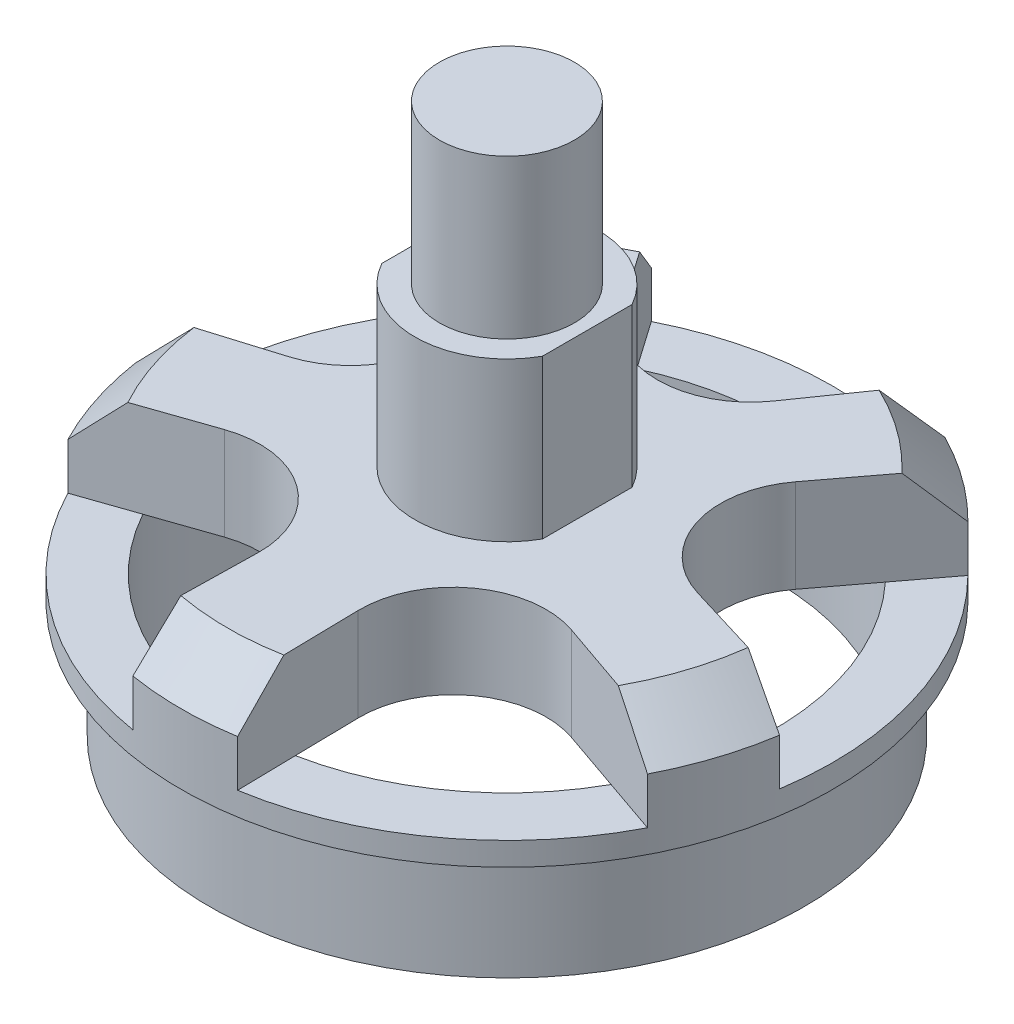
ISO-10303-21;
HEADER;
FILE_DESCRIPTION(('STEP AP214'),'2;1');
FILE_NAME('part.step','',(''),(''),'','','');
FILE_SCHEMA(('AUTOMOTIVE_DESIGN { 1 0 10303 214 1 1 1 1 }'));
ENDSEC;
DATA;
#1=APPLICATION_CONTEXT('core data for automotive mechanical design processes');
#2=APPLICATION_PROTOCOL_DEFINITION('international standard','automotive_design',2000,#1);
#3=PRODUCT_CONTEXT('',#1,'mechanical');
#4=PRODUCT('Part','Part','',(#3));
#5=PRODUCT_RELATED_PRODUCT_CATEGORY('part','',(#4));
#6=PRODUCT_DEFINITION_FORMATION('','',#4);
#7=PRODUCT_DEFINITION_CONTEXT('part definition',#1,'design');
#8=PRODUCT_DEFINITION('design','',#6,#7);
#9=PRODUCT_DEFINITION_SHAPE('','',#8);
#10=(LENGTH_UNIT() NAMED_UNIT(*) SI_UNIT(.MILLI.,.METRE.));
#11=(NAMED_UNIT(*) PLANE_ANGLE_UNIT() SI_UNIT($,.RADIAN.));
#12=(NAMED_UNIT(*) SI_UNIT($,.STERADIAN.) SOLID_ANGLE_UNIT());
#13=UNCERTAINTY_MEASURE_WITH_UNIT(LENGTH_MEASURE(1.E-05),#10,'distance_accuracy_value','');
#14=(GEOMETRIC_REPRESENTATION_CONTEXT(3) GLOBAL_UNCERTAINTY_ASSIGNED_CONTEXT((#13)) GLOBAL_UNIT_ASSIGNED_CONTEXT((#10,
#11,#12)) REPRESENTATION_CONTEXT('',''));
#15=CARTESIAN_POINT('',(0.,0.,0.));
#16=DIRECTION('',(0.,0.,1.));
#17=DIRECTION('',(1.,0.,0.));
#18=AXIS2_PLACEMENT_3D('',#15,#16,#17);
#19=CARTESIAN_POINT('',(0.,10.,0.));
#20=DIRECTION('',(0.,1.,0.));
#21=DIRECTION('',(0.,0.,1.));
#22=AXIS2_PLACEMENT_3D('',#19,#20,#21);
#23=PLANE('',#22);
#24=DIRECTION('',(0.,0.,1.));
#25=VECTOR('',#24,1.);
#26=CARTESIAN_POINT('',(-3.45,10.,-1.92353840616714));
#27=LINE('',#26,#25);
#28=CARTESIAN_POINT('',(-3.45,10.,-1.92353840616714));
#29=VERTEX_POINT('',#28);
#30=CARTESIAN_POINT('',(-3.45,10.,1.92353840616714));
#31=VERTEX_POINT('',#30);
#32=EDGE_CURVE('E499',#29,#31,#27,.T.);
#33=ORIENTED_EDGE('',*,*,#32,.F.);
#34=CARTESIAN_POINT('',(0.,10.,0.));
#35=DIRECTION('',(0.,1.,0.));
#36=DIRECTION('',(0.,0.,1.));
#37=AXIS2_PLACEMENT_3D('',#34,#35,#36);
#38=CIRCLE('',#37,3.95);
#39=CARTESIAN_POINT('',(3.45,10.,-1.92353840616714));
#40=VERTEX_POINT('',#39);
#41=EDGE_CURVE('E483',#40,#29,#38,.T.);
#42=ORIENTED_EDGE('',*,*,#41,.F.);
#43=DIRECTION('',(0.,0.,-1.));
#44=VECTOR('',#43,1.);
#45=CARTESIAN_POINT('',(3.45,10.,-1.92353840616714));
#46=LINE('',#45,#44);
#47=CARTESIAN_POINT('',(3.45,10.,1.92353840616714));
#48=VERTEX_POINT('',#47);
#49=EDGE_CURVE('E490',#48,#40,#46,.T.);
#50=ORIENTED_EDGE('',*,*,#49,.F.);
#51=CARTESIAN_POINT('',(0.,10.,0.));
#52=DIRECTION('',(0.,1.,0.));
#53=DIRECTION('',(0.,0.,1.));
#54=AXIS2_PLACEMENT_3D('',#51,#52,#53);
#55=CIRCLE('',#54,3.95);
#56=EDGE_CURVE('E501',#31,#48,#55,.T.);
#57=ORIENTED_EDGE('',*,*,#56,.F.);
#58=EDGE_LOOP('',(#33,#42,#50,#57));
#59=FACE_BOUND('',#58,.T.);
#60=CARTESIAN_POINT('',(-9.94974789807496,10.,-3.23286906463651));
#61=DIRECTION('',(0.,1.,0.));
#62=DIRECTION('',(0.,0.,1.));
#63=AXIS2_PLACEMENT_3D('',#60,#61,#62);
#64=CIRCLE('',#63,4.);
#65=CARTESIAN_POINT('',(-8.78595913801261,10.,0.594087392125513));
#66=VERTEX_POINT('',#65);
#67=CARTESIAN_POINT('',(-6.7587944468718,10.,-5.64488400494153));
#68=VERTEX_POINT('',#67);
#69=EDGE_CURVE('E343',#66,#68,#64,.T.);
#70=ORIENTED_EDGE('',*,*,#69,.F.);
#71=DIRECTION('',(-0.956739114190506,0.,0.290947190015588));
#72=VECTOR('',#71,1.);
#73=CARTESIAN_POINT('',(-0.578363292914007,10.,-1.90186674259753));
#74=LINE('',#73,#72);
#75=CARTESIAN_POINT('',(-11.9006097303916,10.,1.5412618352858));
#76=VERTEX_POINT('',#75);
#77=EDGE_CURVE('E314',#66,#76,#74,.T.);
#78=ORIENTED_EDGE('',*,*,#77,.T.);
#79=CARTESIAN_POINT('',(0.,10.,0.));
#80=DIRECTION('',(0.,1.,0.));
#81=DIRECTION('',(0.,0.,1.));
#82=AXIS2_PLACEMENT_3D('',#79,#80,#81);
#83=CIRCLE('',#82,12.);
#84=CARTESIAN_POINT('',(-10.5337264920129,10.,5.74809587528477));
#85=VERTEX_POINT('',#84);
#86=EDGE_CURVE('E644',#76,#85,#83,.T.);
#87=ORIENTED_EDGE('',*,*,#86,.T.);
#88=DIRECTION('',(-0.945032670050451,0.,0.326975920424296));
#89=VECTOR('',#88,1.);
#90=CARTESIAN_POINT('',(0.649983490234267,10.,1.87859592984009));
#91=LINE('',#90,#89);
#92=CARTESIAN_POINT('',(-7.45718606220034,10.,4.68363041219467));
#93=VERTEX_POINT('',#92);
#94=EDGE_CURVE('E110',#93,#85,#91,.T.);
#95=ORIENTED_EDGE('',*,*,#94,.F.);
#96=CARTESIAN_POINT('',(-6.14928238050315,10.,8.46376109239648));
#97=DIRECTION('',(0.,1.,0.));
#98=DIRECTION('',(0.,0.,1.));
#99=AXIS2_PLACEMENT_3D('',#96,#97,#98);
#100=CIRCLE('',#99,4.);
#101=CARTESIAN_POINT('',(-2.15,10.,8.53952679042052));
#102=VERTEX_POINT('',#101);
#103=EDGE_CURVE('E401',#102,#93,#100,.T.);
#104=ORIENTED_EDGE('',*,*,#103,.F.);
#105=DIRECTION('',(-0.0189414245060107,0.,0.999820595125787));
#106=VECTOR('',#105,1.);
#107=CARTESIAN_POINT('',(-1.9875068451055,10.,-0.037652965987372));
#108=LINE('',#107,#106);
#109=CARTESIAN_POINT('',(-2.21166353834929,10.,11.7944285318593));
#110=VERTEX_POINT('',#109);
#111=EDGE_CURVE('E398',#102,#110,#108,.T.);
#112=ORIENTED_EDGE('',*,*,#111,.T.);
#113=CARTESIAN_POINT('',(2.21166353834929,10.,11.7944285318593));
#114=VERTEX_POINT('',#113);
#115=EDGE_CURVE('E647',#110,#114,#83,.T.);
#116=ORIENTED_EDGE('',*,*,#115,.T.);
#117=DIRECTION('',(0.0189414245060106,0.,0.999820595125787));
#118=VECTOR('',#117,1.);
#119=CARTESIAN_POINT('',(1.9875068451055,10.,-0.0376529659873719));
#120=LINE('',#119,#118);
#121=CARTESIAN_POINT('',(2.15,10.,8.53952679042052));
#122=VERTEX_POINT('',#121);
#123=EDGE_CURVE('E102',#122,#114,#120,.T.);
#124=ORIENTED_EDGE('',*,*,#123,.F.);
#125=CARTESIAN_POINT('',(6.14928238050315,10.,8.46376109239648));
#126=DIRECTION('',(0.,1.,0.));
#127=DIRECTION('',(0.,0.,1.));
#128=AXIS2_PLACEMENT_3D('',#125,#126,#127);
#129=CIRCLE('',#128,4.);
#130=CARTESIAN_POINT('',(7.45718606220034,10.,4.68363041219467));
#131=VERTEX_POINT('',#130);
#132=EDGE_CURVE('E430',#131,#122,#129,.T.);
#133=ORIENTED_EDGE('',*,*,#132,.F.);
#134=DIRECTION('',(0.945032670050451,0.,0.326975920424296));
#135=VECTOR('',#134,1.);
#136=CARTESIAN_POINT('',(-0.649983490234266,10.,1.87859592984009));
#137=LINE('',#136,#135);
#138=CARTESIAN_POINT('',(10.5337264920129,10.,5.74809587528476));
#139=VERTEX_POINT('',#138);
#140=EDGE_CURVE('E427',#131,#139,#137,.T.);
#141=ORIENTED_EDGE('',*,*,#140,.T.);
#142=CARTESIAN_POINT('',(11.9006097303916,10.,1.5412618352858));
#143=VERTEX_POINT('',#142);
#144=EDGE_CURVE('E526',#139,#143,#83,.T.);
#145=ORIENTED_EDGE('',*,*,#144,.T.);
#146=DIRECTION('',(0.956739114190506,0.,0.290947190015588));
#147=VECTOR('',#146,1.);
#148=CARTESIAN_POINT('',(0.578363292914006,10.,-1.90186674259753));
#149=LINE('',#148,#147);
#150=CARTESIAN_POINT('',(8.78595913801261,10.,0.594087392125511));
#151=VERTEX_POINT('',#150);
#152=EDGE_CURVE('E461',#151,#143,#149,.T.);
#153=ORIENTED_EDGE('',*,*,#152,.F.);
#154=CARTESIAN_POINT('',(9.94974789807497,10.,-3.23286906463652));
#155=DIRECTION('',(0.,1.,0.));
#156=DIRECTION('',(0.,0.,1.));
#157=AXIS2_PLACEMENT_3D('',#154,#155,#156);
#158=CIRCLE('',#157,4.00000000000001);
#159=CARTESIAN_POINT('',(6.7587944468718,10.,-5.64488400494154));
#160=VERTEX_POINT('',#159);
#161=EDGE_CURVE('E458',#160,#151,#158,.T.);
#162=ORIENTED_EDGE('',*,*,#161,.F.);
#163=DIRECTION('',(0.603003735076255,0.,-0.797738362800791));
#164=VECTOR('',#163,1.);
#165=CARTESIAN_POINT('',(1.58579495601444,10.,1.19868910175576));
#166=LINE('',#165,#164);
#167=CARTESIAN_POINT('',(8.72186453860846,10.,-8.24190991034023));
#168=VERTEX_POINT('',#167);
#169=EDGE_CURVE('E378',#160,#168,#166,.T.);
#170=ORIENTED_EDGE('',*,*,#169,.T.);
#171=CARTESIAN_POINT('',(5.14331776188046,10.,-10.8418763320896));
#172=VERTEX_POINT('',#171);
#173=EDGE_CURVE('E531',#168,#172,#83,.T.);
#174=ORIENTED_EDGE('',*,*,#173,.T.);
#175=DIRECTION('',(-0.572355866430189,0.,0.82000534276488));
#176=VECTOR('',#175,1.);
#177=CARTESIAN_POINT('',(-1.63005867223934,10.,-1.13776532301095));
#178=LINE('',#177,#176);
#179=CARTESIAN_POINT('',(3.28002137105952,10.,-8.17236058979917));
#180=VERTEX_POINT('',#179);
#181=EDGE_CURVE('E373',#172,#180,#178,.T.);
#182=ORIENTED_EDGE('',*,*,#181,.T.);
#183=CARTESIAN_POINT('',(0.,10.,-10.4617840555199));
#184=DIRECTION('',(0.,1.,0.));
#185=DIRECTION('',(0.,0.,1.));
#186=AXIS2_PLACEMENT_3D('',#183,#184,#185);
#187=CIRCLE('',#186,4.00000000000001);
#188=CARTESIAN_POINT('',(-3.28002137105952,10.,-8.17236058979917));
#189=VERTEX_POINT('',#188);
#190=EDGE_CURVE('E370',#189,#180,#187,.T.);
#191=ORIENTED_EDGE('',*,*,#190,.F.);
#192=DIRECTION('',(-0.572355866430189,0.,-0.82000534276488));
#193=VECTOR('',#192,1.);
#194=CARTESIAN_POINT('',(1.63005867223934,10.,-1.13776532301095));
#195=LINE('',#194,#193);
#196=CARTESIAN_POINT('',(-5.14331776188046,10.,-10.8418763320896));
#197=VERTEX_POINT('',#196);
#198=EDGE_CURVE('E349',#189,#197,#195,.T.);
#199=ORIENTED_EDGE('',*,*,#198,.T.);
#200=CARTESIAN_POINT('',(-8.72186453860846,10.,-8.24190991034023));
#201=VERTEX_POINT('',#200);
#202=EDGE_CURVE('E535',#197,#201,#83,.T.);
#203=ORIENTED_EDGE('',*,*,#202,.T.);
#204=DIRECTION('',(-0.603003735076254,0.,-0.797738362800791));
#205=VECTOR('',#204,1.);
#206=CARTESIAN_POINT('',(-1.58579495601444,10.,1.19868910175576));
#207=LINE('',#206,#205);
#208=EDGE_CURVE('E336',#68,#201,#207,.T.);
#209=ORIENTED_EDGE('',*,*,#208,.F.);
#210=EDGE_LOOP('',(#70,#78,#87,#95,#104,#112,#116,#124,#133,#141,#145,#153,#162,#170,#174,#182,
#191,#199,#203,#209));
#211=FACE_BOUND('',#210,.T.);
#212=ADVANCED_FACE('F82',(#59,#211),#23,.T.);
#213=CARTESIAN_POINT('',(0.,6.,0.));
#214=DIRECTION('',(0.,-1.,0.));
#215=DIRECTION('',(0.,0.,-1.));
#216=AXIS2_PLACEMENT_3D('',#213,#214,#215);
#217=PLANE('',#216);
#218=CARTESIAN_POINT('',(0.,6.,0.));
#219=DIRECTION('',(0.,-1.,0.));
#220=DIRECTION('',(0.,0.,-1.));
#221=AXIS2_PLACEMENT_3D('',#218,#219,#220);
#222=CIRCLE('',#221,1.5);
#223=CARTESIAN_POINT('',(0.,6.,-1.5));
#224=VERTEX_POINT('',#223);
#225=EDGE_CURVE('E467',#224,#224,#222,.T.);
#226=ORIENTED_EDGE('',*,*,#225,.F.);
#227=EDGE_LOOP('',(#226));
#228=FACE_BOUND('',#227,.T.);
#229=CARTESIAN_POINT('',(0.,6.,0.));
#230=DIRECTION('',(0.,-1.,0.));
#231=DIRECTION('',(0.,0.,-1.));
#232=AXIS2_PLACEMENT_3D('',#229,#230,#231);
#233=CIRCLE('',#232,11.5);
#234=CARTESIAN_POINT('',(-10.0542960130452,6.,5.58221566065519));
#235=VERTEX_POINT('',#234);
#236=CARTESIAN_POINT('',(-11.415240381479,6.,1.39365958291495));
#237=VERTEX_POINT('',#236);
#238=EDGE_CURVE('E333',#235,#237,#233,.T.);
#239=ORIENTED_EDGE('',*,*,#238,.T.);
#240=DIRECTION('',(-0.956739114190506,0.,0.290947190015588));
#241=VECTOR('',#240,1.);
#242=CARTESIAN_POINT('',(-0.578363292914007,6.,-1.90186674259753));
#243=LINE('',#242,#241);
#244=CARTESIAN_POINT('',(-8.78595913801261,6.,0.594087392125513));
#245=VERTEX_POINT('',#244);
#246=EDGE_CURVE('E311',#245,#237,#243,.T.);
#247=ORIENTED_EDGE('',*,*,#246,.F.);
#248=CARTESIAN_POINT('',(-9.94974789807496,6.,-3.23286906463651));
#249=DIRECTION('',(0.,1.,0.));
#250=DIRECTION('',(0.,0.,1.));
#251=AXIS2_PLACEMENT_3D('',#248,#249,#250);
#252=CIRCLE('',#251,4.);
#253=CARTESIAN_POINT('',(-6.7587944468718,6.,-5.64488400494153));
#254=VERTEX_POINT('',#253);
#255=EDGE_CURVE('E322',#245,#254,#252,.T.);
#256=ORIENTED_EDGE('',*,*,#255,.T.);
#257=DIRECTION('',(-0.603003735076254,0.,-0.797738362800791));
#258=VECTOR('',#257,1.);
#259=CARTESIAN_POINT('',(-1.58579495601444,6.,1.19868910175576));
#260=LINE('',#259,#258);
#261=CARTESIAN_POINT('',(-8.41595091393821,6.,-7.83720423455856));
#262=VERTEX_POINT('',#261);
#263=EDGE_CURVE('E338',#254,#262,#260,.T.);
#264=ORIENTED_EDGE('',*,*,#263,.T.);
#265=CARTESIAN_POINT('',(-4.85295230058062,6.,-10.425874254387));
#266=VERTEX_POINT('',#265);
#267=EDGE_CURVE('E692',#262,#266,#233,.T.);
#268=ORIENTED_EDGE('',*,*,#267,.T.);
#269=DIRECTION('',(-0.572355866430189,0.,-0.82000534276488));
#270=VECTOR('',#269,1.);
#271=CARTESIAN_POINT('',(1.63005867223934,6.,-1.13776532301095));
#272=LINE('',#271,#270);
#273=CARTESIAN_POINT('',(-3.28002137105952,6.,-8.17236058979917));
#274=VERTEX_POINT('',#273);
#275=EDGE_CURVE('E354',#274,#266,#272,.T.);
#276=ORIENTED_EDGE('',*,*,#275,.F.);
#277=CARTESIAN_POINT('',(0.,6.,-10.4617840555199));
#278=DIRECTION('',(0.,1.,0.));
#279=DIRECTION('',(0.,0.,1.));
#280=AXIS2_PLACEMENT_3D('',#277,#278,#279);
#281=CIRCLE('',#280,4.00000000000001);
#282=CARTESIAN_POINT('',(3.28002137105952,6.,-8.17236058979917));
#283=VERTEX_POINT('',#282);
#284=EDGE_CURVE('E356',#274,#283,#281,.T.);
#285=ORIENTED_EDGE('',*,*,#284,.T.);
#286=DIRECTION('',(-0.572355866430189,0.,0.82000534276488));
#287=VECTOR('',#286,1.);
#288=CARTESIAN_POINT('',(-1.63005867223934,6.,-1.13776532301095));
#289=LINE('',#288,#287);
#290=CARTESIAN_POINT('',(4.85295230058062,6.,-10.425874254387));
#291=VERTEX_POINT('',#290);
#292=EDGE_CURVE('E360',#291,#283,#289,.T.);
#293=ORIENTED_EDGE('',*,*,#292,.F.);
#294=CARTESIAN_POINT('',(8.41595091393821,6.,-7.83720423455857));
#295=VERTEX_POINT('',#294);
#296=EDGE_CURVE('E528',#291,#295,#233,.T.);
#297=ORIENTED_EDGE('',*,*,#296,.T.);
#298=DIRECTION('',(0.603003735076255,0.,-0.797738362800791));
#299=VECTOR('',#298,1.);
#300=CARTESIAN_POINT('',(1.58579495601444,6.,1.19868910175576));
#301=LINE('',#300,#299);
#302=CARTESIAN_POINT('',(6.7587944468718,6.,-5.64488400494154));
#303=VERTEX_POINT('',#302);
#304=EDGE_CURVE('E441',#303,#295,#301,.T.);
#305=ORIENTED_EDGE('',*,*,#304,.F.);
#306=CARTESIAN_POINT('',(9.94974789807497,6.,-3.23286906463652));
#307=DIRECTION('',(0.,1.,0.));
#308=DIRECTION('',(0.,0.,1.));
#309=AXIS2_PLACEMENT_3D('',#306,#307,#308);
#310=CIRCLE('',#309,4.00000000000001);
#311=CARTESIAN_POINT('',(8.78595913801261,6.,0.59408739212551));
#312=VERTEX_POINT('',#311);
#313=EDGE_CURVE('E444',#303,#312,#310,.T.);
#314=ORIENTED_EDGE('',*,*,#313,.T.);
#315=DIRECTION('',(0.956739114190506,0.,0.290947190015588));
#316=VECTOR('',#315,1.);
#317=CARTESIAN_POINT('',(0.578363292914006,6.,-1.90186674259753));
#318=LINE('',#317,#316);
#319=CARTESIAN_POINT('',(11.415240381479,6.,1.39365958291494));
#320=VERTEX_POINT('',#319);
#321=EDGE_CURVE('E449',#312,#320,#318,.T.);
#322=ORIENTED_EDGE('',*,*,#321,.T.);
#323=CARTESIAN_POINT('',(10.0542960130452,6.,5.58221566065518));
#324=VERTEX_POINT('',#323);
#325=EDGE_CURVE('E527',#320,#324,#233,.T.);
#326=ORIENTED_EDGE('',*,*,#325,.T.);
#327=DIRECTION('',(0.945032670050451,0.,0.326975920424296));
#328=VECTOR('',#327,1.);
#329=CARTESIAN_POINT('',(-0.649983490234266,6.,1.87859592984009));
#330=LINE('',#329,#328);
#331=CARTESIAN_POINT('',(7.45718606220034,6.,4.68363041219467));
#332=VERTEX_POINT('',#331);
#333=EDGE_CURVE('E413',#332,#324,#330,.T.);
#334=ORIENTED_EDGE('',*,*,#333,.F.);
#335=CARTESIAN_POINT('',(6.14928238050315,6.,8.46376109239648));
#336=DIRECTION('',(0.,1.,0.));
#337=DIRECTION('',(0.,0.,1.));
#338=AXIS2_PLACEMENT_3D('',#335,#336,#337);
#339=CIRCLE('',#338,4.);
#340=CARTESIAN_POINT('',(2.15,6.,8.53952679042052));
#341=VERTEX_POINT('',#340);
#342=EDGE_CURVE('E415',#332,#341,#339,.T.);
#343=ORIENTED_EDGE('',*,*,#342,.T.);
#344=DIRECTION('',(0.0189414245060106,0.,0.999820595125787));
#345=VECTOR('',#344,1.);
#346=CARTESIAN_POINT('',(1.9875068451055,6.,-0.0376529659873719));
#347=LINE('',#346,#345);
#348=CARTESIAN_POINT('',(2.20205424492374,6.,11.2872032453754));
#349=VERTEX_POINT('',#348);
#350=EDGE_CURVE('E420',#341,#349,#347,.T.);
#351=ORIENTED_EDGE('',*,*,#350,.T.);
#352=CARTESIAN_POINT('',(-2.20205424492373,6.,11.2872032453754));
#353=VERTEX_POINT('',#352);
#354=EDGE_CURVE('E680',#349,#353,#233,.T.);
#355=ORIENTED_EDGE('',*,*,#354,.T.);
#356=DIRECTION('',(-0.0189414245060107,0.,0.999820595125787));
#357=VECTOR('',#356,1.);
#358=CARTESIAN_POINT('',(-1.9875068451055,6.,-0.037652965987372));
#359=LINE('',#358,#357);
#360=CARTESIAN_POINT('',(-2.15,6.,8.53952679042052));
#361=VERTEX_POINT('',#360);
#362=EDGE_CURVE('E385',#361,#353,#359,.T.);
#363=ORIENTED_EDGE('',*,*,#362,.F.);
#364=CARTESIAN_POINT('',(-6.14928238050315,6.,8.46376109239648));
#365=DIRECTION('',(0.,1.,0.));
#366=DIRECTION('',(0.,0.,1.));
#367=AXIS2_PLACEMENT_3D('',#364,#365,#366);
#368=CIRCLE('',#367,4.);
#369=CARTESIAN_POINT('',(-7.45718606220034,6.,4.68363041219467));
#370=VERTEX_POINT('',#369);
#371=EDGE_CURVE('E387',#361,#370,#368,.T.);
#372=ORIENTED_EDGE('',*,*,#371,.T.);
#373=DIRECTION('',(-0.945032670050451,0.,0.326975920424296));
#374=VECTOR('',#373,1.);
#375=CARTESIAN_POINT('',(0.649983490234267,6.,1.87859592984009));
#376=LINE('',#375,#374);
#377=EDGE_CURVE('E392',#370,#235,#376,.T.);
#378=ORIENTED_EDGE('',*,*,#377,.T.);
#379=EDGE_LOOP('',(#239,#247,#256,#264,#268,#276,#285,#293,#297,#305,#314,#322,#326,#334,#343,
#351,#355,#363,#372,#378));
#380=FACE_BOUND('',#379,.T.);
#381=ADVANCED_FACE('F330',(#228,#380),#217,.T.);
#382=CARTESIAN_POINT('',(0.,10.,0.));
#383=DIRECTION('',(0.,-1.,0.));
#384=DIRECTION('',(0.,0.,-1.));
#385=AXIS2_PLACEMENT_3D('',#382,#383,#384);
#386=CYLINDRICAL_SURFACE('',#385,14.);
#387=CARTESIAN_POINT('',(0.,5.,0.));
#388=DIRECTION('',(0.,-1.,0.));
#389=DIRECTION('',(0.,0.,-1.));
#390=AXIS2_PLACEMENT_3D('',#387,#388,#389);
#391=CIRCLE('',#390,14.);
#392=CARTESIAN_POINT('',(0.,5.,-14.));
#393=VERTEX_POINT('',#392);
#394=EDGE_CURVE('E518',#393,#393,#391,.T.);
#395=ORIENTED_EDGE('',*,*,#394,.F.);
#396=EDGE_LOOP('',(#395));
#397=FACE_BOUND('',#396,.T.);
#398=DIRECTION('',(0.,1.,0.));
#399=VECTOR('',#398,1.);
#400=CARTESIAN_POINT('',(-13.8370001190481,6.,2.13012387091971));
#401=LINE('',#400,#399);
#402=CARTESIAN_POINT('',(-13.8370001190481,6.,2.13012387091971));
#403=VERTEX_POINT('',#402);
#404=CARTESIAN_POINT('',(-13.8370001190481,8.,2.13012387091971));
#405=VERTEX_POINT('',#404);
#406=EDGE_CURVE('E347',#403,#405,#401,.T.);
#407=ORIENTED_EDGE('',*,*,#406,.F.);
#408=CARTESIAN_POINT('',(0.,6.,0.));
#409=DIRECTION('',(0.,1.,0.));
#410=DIRECTION('',(0.,0.,1.));
#411=AXIS2_PLACEMENT_3D('',#408,#409,#410);
#412=CIRCLE('',#411,14.);
#413=CARTESIAN_POINT('',(-9.94231285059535,6.,-9.85649101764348));
#414=VERTEX_POINT('',#413);
#415=EDGE_CURVE('E319',#414,#403,#412,.T.);
#416=ORIENTED_EDGE('',*,*,#415,.F.);
#417=DIRECTION('',(0.,1.,0.));
#418=VECTOR('',#417,1.);
#419=CARTESIAN_POINT('',(-9.94231285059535,6.,-9.85649101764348));
#420=LINE('',#419,#418);
#421=CARTESIAN_POINT('',(-9.94231285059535,8.,-9.85649101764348));
#422=VERTEX_POINT('',#421);
#423=EDGE_CURVE('E350',#414,#422,#420,.T.);
#424=ORIENTED_EDGE('',*,*,#423,.T.);
#425=CARTESIAN_POINT('',(0.,8.,0.));
#426=DIRECTION('',(0.,1.,0.));
#427=DIRECTION('',(0.,0.,1.));
#428=AXIS2_PLACEMENT_3D('',#425,#426,#427);
#429=CIRCLE('',#428,14.);
#430=CARTESIAN_POINT('',(-6.30173637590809,8.,-12.5015246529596));
#431=VERTEX_POINT('',#430);
#432=EDGE_CURVE('E804',#422,#431,#429,.F.);
#433=ORIENTED_EDGE('',*,*,#432,.T.);
#434=DIRECTION('',(0.,1.,0.));
#435=VECTOR('',#434,1.);
#436=CARTESIAN_POINT('',(-6.30173637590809,6.,-12.5015246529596));
#437=LINE('',#436,#435);
#438=CARTESIAN_POINT('',(-6.30173637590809,6.,-12.5015246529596));
#439=VERTEX_POINT('',#438);
#440=EDGE_CURVE('E376',#439,#431,#437,.T.);
#441=ORIENTED_EDGE('',*,*,#440,.F.);
#442=CARTESIAN_POINT('',(0.,6.,0.));
#443=DIRECTION('',(0.,1.,0.));
#444=DIRECTION('',(0.,0.,1.));
#445=AXIS2_PLACEMENT_3D('',#442,#443,#444);
#446=CIRCLE('',#445,14.);
#447=CARTESIAN_POINT('',(6.30173637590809,6.,-12.5015246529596));
#448=VERTEX_POINT('',#447);
#449=EDGE_CURVE('E364',#448,#439,#446,.T.);
#450=ORIENTED_EDGE('',*,*,#449,.F.);
#451=DIRECTION('',(0.,1.,0.));
#452=VECTOR('',#451,1.);
#453=CARTESIAN_POINT('',(6.30173637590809,6.,-12.5015246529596));
#454=LINE('',#453,#452);
#455=CARTESIAN_POINT('',(6.30173637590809,7.99999999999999,-12.5015246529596));
#456=VERTEX_POINT('',#455);
#457=EDGE_CURVE('E379',#448,#456,#454,.T.);
#458=ORIENTED_EDGE('',*,*,#457,.T.);
#459=CARTESIAN_POINT('',(9.94231285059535,8.,-9.85649101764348));
#460=VERTEX_POINT('',#459);
#461=EDGE_CURVE('E534',#456,#460,#429,.F.);
#462=ORIENTED_EDGE('',*,*,#461,.T.);
#463=DIRECTION('',(0.,1.,0.));
#464=VECTOR('',#463,1.);
#465=CARTESIAN_POINT('',(9.94231285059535,6.,-9.85649101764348));
#466=LINE('',#465,#464);
#467=CARTESIAN_POINT('',(9.94231285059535,6.,-9.85649101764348));
#468=VERTEX_POINT('',#467);
#469=EDGE_CURVE('E464',#468,#460,#466,.T.);
#470=ORIENTED_EDGE('',*,*,#469,.F.);
#471=CARTESIAN_POINT('',(0.,6.,0.));
#472=DIRECTION('',(0.,1.,0.));
#473=DIRECTION('',(0.,0.,1.));
#474=AXIS2_PLACEMENT_3D('',#471,#472,#473);
#475=CIRCLE('',#474,14.);
#476=CARTESIAN_POINT('',(13.8370001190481,6.,2.13012387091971));
#477=VERTEX_POINT('',#476);
#478=EDGE_CURVE('E452',#477,#468,#475,.T.);
#479=ORIENTED_EDGE('',*,*,#478,.F.);
#480=DIRECTION('',(0.,1.,0.));
#481=VECTOR('',#480,1.);
#482=CARTESIAN_POINT('',(13.8370001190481,6.,2.13012387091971));
#483=LINE('',#482,#481);
#484=CARTESIAN_POINT('',(13.8370001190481,7.99999999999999,2.13012387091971));
#485=VERTEX_POINT('',#484);
#486=EDGE_CURVE('E468',#477,#485,#483,.T.);
#487=ORIENTED_EDGE('',*,*,#486,.T.);
#488=CARTESIAN_POINT('',(12.4464236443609,8.,6.4098781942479));
#489=VERTEX_POINT('',#488);
#490=EDGE_CURVE('E536',#485,#489,#429,.F.);
#491=ORIENTED_EDGE('',*,*,#490,.T.);
#492=DIRECTION('',(0.,1.,0.));
#493=VECTOR('',#492,1.);
#494=CARTESIAN_POINT('',(12.4464236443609,6.,6.4098781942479));
#495=LINE('',#494,#493);
#496=CARTESIAN_POINT('',(12.4464236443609,6.,6.4098781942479));
#497=VERTEX_POINT('',#496);
#498=EDGE_CURVE('E402',#497,#489,#495,.T.);
#499=ORIENTED_EDGE('',*,*,#498,.F.);
#500=CARTESIAN_POINT('',(0.,6.,0.));
#501=DIRECTION('',(0.,1.,0.));
#502=DIRECTION('',(0.,0.,1.));
#503=AXIS2_PLACEMENT_3D('',#500,#501,#502);
#504=CIRCLE('',#503,14.);
#505=CARTESIAN_POINT('',(2.25,6.,13.8180136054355));
#506=VERTEX_POINT('',#505);
#507=EDGE_CURVE('E423',#506,#497,#504,.T.);
#508=ORIENTED_EDGE('',*,*,#507,.F.);
#509=DIRECTION('',(0.,1.,0.));
#510=VECTOR('',#509,1.);
#511=CARTESIAN_POINT('',(2.25,6.,13.8180136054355));
#512=LINE('',#511,#510);
#513=CARTESIAN_POINT('',(2.25,7.99999999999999,13.8180136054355));
#514=VERTEX_POINT('',#513);
#515=EDGE_CURVE('E435',#506,#514,#512,.T.);
#516=ORIENTED_EDGE('',*,*,#515,.T.);
#517=CARTESIAN_POINT('',(-2.25,8.,13.8180136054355));
#518=VERTEX_POINT('',#517);
#519=EDGE_CURVE('E540',#514,#518,#429,.F.);
#520=ORIENTED_EDGE('',*,*,#519,.T.);
#521=DIRECTION('',(0.,1.,0.));
#522=VECTOR('',#521,1.);
#523=CARTESIAN_POINT('',(-2.25,6.,13.8180136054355));
#524=LINE('',#523,#522);
#525=CARTESIAN_POINT('',(-2.25,6.,13.8180136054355));
#526=VERTEX_POINT('',#525);
#527=EDGE_CURVE('E344',#526,#518,#524,.T.);
#528=ORIENTED_EDGE('',*,*,#527,.F.);
#529=CARTESIAN_POINT('',(0.,6.,0.));
#530=DIRECTION('',(0.,1.,0.));
#531=DIRECTION('',(0.,0.,1.));
#532=AXIS2_PLACEMENT_3D('',#529,#530,#531);
#533=CIRCLE('',#532,14.);
#534=CARTESIAN_POINT('',(-12.4464236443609,6.,6.4098781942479));
#535=VERTEX_POINT('',#534);
#536=EDGE_CURVE('E394',#535,#526,#533,.T.);
#537=ORIENTED_EDGE('',*,*,#536,.F.);
#538=DIRECTION('',(0.,1.,0.));
#539=VECTOR('',#538,1.);
#540=CARTESIAN_POINT('',(-12.4464236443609,6.,6.4098781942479));
#541=LINE('',#540,#539);
#542=CARTESIAN_POINT('',(-12.4464236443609,7.99999999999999,6.4098781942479));
#543=VERTEX_POINT('',#542);
#544=EDGE_CURVE('E407',#535,#543,#541,.T.);
#545=ORIENTED_EDGE('',*,*,#544,.T.);
#546=EDGE_CURVE('E641',#543,#405,#429,.F.);
#547=ORIENTED_EDGE('',*,*,#546,.T.);
#548=EDGE_LOOP('',(#407,#416,#424,#433,#441,#450,#458,#462,#470,#479,#487,#491,#499,#508,#516,
#520,#528,#537,#545,#547));
#549=FACE_BOUND('',#548,.T.);
#550=ADVANCED_FACE('F618',(#397,#549),#386,.T.);
#551=CARTESIAN_POINT('',(0.,10.,0.));
#552=DIRECTION('',(0.,-1.,0.));
#553=DIRECTION('',(0.,0.,-1.));
#554=AXIS2_PLACEMENT_3D('',#551,#552,#553);
#555=CONICAL_SURFACE('',#554,12.,0.785398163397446);
#556=ORIENTED_EDGE('',*,*,#86,.F.);
#557=CARTESIAN_POINT('',(-11.9004157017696,10.0002,1.54120283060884));
#558=CARTESIAN_POINT('',(-12.2235087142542,9.66711151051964,1.63945636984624));
#559=CARTESIAN_POINT('',(-12.5464539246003,9.33386668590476,1.73766496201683));
#560=CARTESIAN_POINT('',(-13.19204873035,8.66706437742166,1.93399224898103));
#561=CARTESIAN_POINT('',(-13.5146983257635,8.33350689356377,2.03211094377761));
#562=CARTESIAN_POINT('',(-13.8372001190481,7.99979307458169,2.13018469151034));
#563=B_SPLINE_CURVE_WITH_KNOTS('',3,(#557,#558,#559,#560,#561,#562),.UNSPECIFIED.,.F.,.F.,(4,2,
4),(0.,1.42299537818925,2.8459907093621),.UNSPECIFIED.);
#564=EDGE_CURVE('E12',#76,#405,#563,.T.);
#565=ORIENTED_EDGE('',*,*,#564,.T.);
#566=ORIENTED_EDGE('',*,*,#546,.F.);
#567=CARTESIAN_POINT('',(-8.64678301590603,11.9636577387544,5.0952241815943));
#568=CARTESIAN_POINT('',(-8.96174808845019,11.6369598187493,5.20420030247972));
#569=CARTESIAN_POINT('',(-9.27642113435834,11.3099471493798,5.31307538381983));
#570=CARTESIAN_POINT('',(-9.90529954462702,10.6554190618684,5.53066373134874));
#571=CARTESIAN_POINT('',(-10.2195049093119,10.3279036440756,5.63937699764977));
#572=CARTESIAN_POINT('',(-11.1718615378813,9.33407882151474,5.96888696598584));
#573=CARTESIAN_POINT('',(-11.8094633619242,8.66717992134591,6.18949356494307));
#574=CARTESIAN_POINT('',(-12.4466176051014,7.99979683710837,6.40994530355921));
#575=CARTESIAN_POINT('',(-12.4466206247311,7.99979367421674,6.4099463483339));
#576=CARTESIAN_POINT('',(-13.0786508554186,7.33777769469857,6.62862520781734));
#577=CARTESIAN_POINT('',(-13.710234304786,6.67529053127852,6.84714948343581));
#578=CARTESIAN_POINT('',(-14.9727803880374,5.34965288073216,7.28398323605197));
#579=CARTESIAN_POINT('',(-15.6037430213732,4.68650239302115,7.50229271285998));
#580=CARTESIAN_POINT('',(-16.2345280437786,4.02316351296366,7.72054073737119));
#581=B_SPLINE_CURVE_WITH_KNOTS('',3,(#567,#568,#569,#570,#571,#572,#573,#574,#575,#576,#577,
#578,#579,#580),.UNSPECIFIED.,.F.,.F.,(4,2,2,2,2,2,4),(0.,1.4001038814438,2.80020679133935,
5.64618735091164,5.64620083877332,8.46929385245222,11.2923893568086),.UNSPECIFIED.);
#582=EDGE_CURVE('E645',#85,#543,#581,.T.);
#583=ORIENTED_EDGE('',*,*,#582,.F.);
#584=EDGE_LOOP('',(#556,#565,#566,#583));
#585=FACE_BOUND('',#584,.T.);
#586=ADVANCED_FACE('F84',(#585),#555,.T.);
#587=CARTESIAN_POINT('',(-8.72174224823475,10.0002,-8.24174812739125));
#588=CARTESIAN_POINT('',(-8.92537730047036,9.66711266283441,-8.51114528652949));
#589=CARTESIAN_POINT('',(-9.12891919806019,9.33386899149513,-8.78041920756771));
#590=CARTESIAN_POINT('',(-9.5358166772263,8.6670689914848,-9.31872056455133));
#591=CARTESIAN_POINT('',(-9.73917225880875,8.33351266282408,-9.58774800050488));
#592=CARTESIAN_POINT('',(-9.94243468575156,7.9998,-9.85665219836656));
#593=B_SPLINE_CURVE_WITH_KNOTS('',3,(#587,#588,#589,#590,#591,#592),.UNSPECIFIED.,.F.,.F.,(4,2,
4),(0.,1.42299045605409,2.84598086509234),.UNSPECIFIED.);
#594=EDGE_CURVE('E95',#201,#422,#593,.T.);
#595=ORIENTED_EDGE('',*,*,#594,.F.);
#596=ORIENTED_EDGE('',*,*,#202,.F.);
#597=CARTESIAN_POINT('',(-5.14320168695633,10.0002,-10.8417100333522));
#598=CARTESIAN_POINT('',(-5.33648691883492,9.66711266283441,-11.118626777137));
#599=CARTESIAN_POINT('',(-5.52968373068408,9.33386899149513,-11.3954168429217));
#600=CARTESIAN_POINT('',(-5.91590050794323,8.6670689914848,-11.9487436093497));
#601=CARTESIAN_POINT('',(-6.10892047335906,8.33351266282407,-12.2252803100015));
#602=CARTESIAN_POINT('',(-6.3018520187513,7.9998,-12.5016903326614));
#603=B_SPLINE_CURVE_WITH_KNOTS('',3,(#597,#598,#599,#600,#601,#602),.UNSPECIFIED.,.F.,.F.,(4,2,
4),(0.,1.42299045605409,2.84598086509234),.UNSPECIFIED.);
#604=EDGE_CURVE('E715',#197,#431,#603,.T.);
#605=ORIENTED_EDGE('',*,*,#604,.T.);
#606=ORIENTED_EDGE('',*,*,#432,.F.);
#607=EDGE_LOOP('',(#595,#596,#605,#606));
#608=FACE_BOUND('',#607,.T.);
#609=ADVANCED_FACE('F633',(#608),#555,.T.);
#610=ORIENTED_EDGE('',*,*,#461,.F.);
#611=CARTESIAN_POINT('',(6.3018520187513,7.9998,-12.5016903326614));
#612=CARTESIAN_POINT('',(6.10892047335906,8.33351266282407,-12.2252803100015));
#613=CARTESIAN_POINT('',(5.91590050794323,8.6670689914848,-11.9487436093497));
#614=CARTESIAN_POINT('',(5.52968373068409,9.33386899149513,-11.3954168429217));
#615=CARTESIAN_POINT('',(5.33648691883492,9.6671126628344,-11.118626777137));
#616=CARTESIAN_POINT('',(5.14320168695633,10.0002,-10.8417100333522));
#617=B_SPLINE_CURVE_WITH_KNOTS('',3,(#611,#612,#613,#614,#615,#616),.UNSPECIFIED.,.F.,.F.,(4,2,
4),(0.,1.42299040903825,2.84598086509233),.UNSPECIFIED.);
#618=EDGE_CURVE('E713',#456,#172,#617,.T.);
#619=ORIENTED_EDGE('',*,*,#618,.T.);
#620=ORIENTED_EDGE('',*,*,#173,.F.);
#621=CARTESIAN_POINT('',(8.72174224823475,10.0002,-8.24174812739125));
#622=CARTESIAN_POINT('',(8.92537730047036,9.66711266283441,-8.51114528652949));
#623=CARTESIAN_POINT('',(9.12891919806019,9.33386899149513,-8.78041920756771));
#624=CARTESIAN_POINT('',(9.5358166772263,8.6670689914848,-9.31872056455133));
#625=CARTESIAN_POINT('',(9.73917225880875,8.33351266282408,-9.58774800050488));
#626=CARTESIAN_POINT('',(9.94243468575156,7.9998,-9.85665219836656));
#627=B_SPLINE_CURVE_WITH_KNOTS('',3,(#621,#622,#623,#624,#625,#626),.UNSPECIFIED.,.F.,.F.,(4,2,
4),(0.,1.42299045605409,2.84598086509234),.UNSPECIFIED.);
#628=EDGE_CURVE('E546',#168,#460,#627,.T.);
#629=ORIENTED_EDGE('',*,*,#628,.T.);
#630=EDGE_LOOP('',(#610,#619,#620,#629));
#631=FACE_BOUND('',#630,.T.);
#632=ADVANCED_FACE('F712',(#631),#555,.T.);
#633=ORIENTED_EDGE('',*,*,#115,.F.);
#634=CARTESIAN_POINT('',(-2.21165969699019,10.0002,11.794225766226));
#635=CARTESIAN_POINT('',(-2.21805623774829,9.66711266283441,12.1318663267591));
#636=CARTESIAN_POINT('',(-2.22444985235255,9.33386899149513,12.4693524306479));
#637=CARTESIAN_POINT('',(-2.23723122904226,8.6670689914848,13.1440157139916));
#638=CARTESIAN_POINT('',(-2.2436189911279,8.33351266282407,13.4811928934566));
#639=CARTESIAN_POINT('',(-2.2500038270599,7.9998,13.8182156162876));
#640=B_SPLINE_CURVE_WITH_KNOTS('',3,(#634,#635,#636,#637,#638,#639),.UNSPECIFIED.,.F.,.F.,(4,2,
4),(0.,1.42299045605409,2.84598086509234),.UNSPECIFIED.);
#641=EDGE_CURVE('E716',#110,#518,#640,.T.);
#642=ORIENTED_EDGE('',*,*,#641,.T.);
#643=ORIENTED_EDGE('',*,*,#519,.F.);
#644=CARTESIAN_POINT('',(2.21165969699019,10.0002,11.794225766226));
#645=CARTESIAN_POINT('',(2.21805623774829,9.66711266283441,12.1318663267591));
#646=CARTESIAN_POINT('',(2.22444985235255,9.33386899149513,12.4693524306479));
#647=CARTESIAN_POINT('',(2.23723122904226,8.6670689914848,13.1440157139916));
#648=CARTESIAN_POINT('',(2.2436189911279,8.33351266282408,13.4811928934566));
#649=CARTESIAN_POINT('',(2.2500038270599,7.9998,13.8182156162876));
#650=B_SPLINE_CURVE_WITH_KNOTS('',3,(#644,#645,#646,#647,#648,#649),.UNSPECIFIED.,.F.,.F.,(4,2,
4),(0.,1.42299045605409,2.84598086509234),.UNSPECIFIED.);
#651=EDGE_CURVE('E767',#114,#514,#650,.T.);
#652=ORIENTED_EDGE('',*,*,#651,.F.);
#653=EDGE_LOOP('',(#633,#642,#643,#652));
#654=FACE_BOUND('',#653,.T.);
#655=ADVANCED_FACE('F800',(#654),#555,.T.);
#656=ORIENTED_EDGE('',*,*,#144,.F.);
#657=CARTESIAN_POINT('',(8.64678301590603,11.9636577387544,5.09522418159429));
#658=CARTESIAN_POINT('',(8.96174808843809,11.6369598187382,5.20420030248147));
#659=CARTESIAN_POINT('',(9.27642113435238,11.3099471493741,5.31307538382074));
#660=CARTESIAN_POINT('',(9.90529954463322,10.6554190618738,5.53066373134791));
#661=CARTESIAN_POINT('',(10.2195049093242,10.3279036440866,5.63937699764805));
#662=CARTESIAN_POINT('',(11.1718615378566,9.33407882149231,5.96888696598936));
#663=CARTESIAN_POINT('',(11.8094633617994,8.66717992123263,6.18949356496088));
#664=CARTESIAN_POINT('',(12.4466176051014,7.99979683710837,6.40994530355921));
#665=CARTESIAN_POINT('',(12.4466206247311,7.99979367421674,6.4099463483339));
#666=CARTESIAN_POINT('',(13.0786508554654,7.33777769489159,6.62862520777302));
#667=CARTESIAN_POINT('',(13.7102343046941,6.67529053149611,6.84714948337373));
#668=CARTESIAN_POINT('',(14.9727803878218,5.34965288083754,7.28398323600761));
#669=CARTESIAN_POINT('',(15.6037430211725,4.68650239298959,7.50229271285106));
#670=CARTESIAN_POINT('',(16.2345280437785,4.02316351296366,7.72054073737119));
#671=B_SPLINE_CURVE_WITH_KNOTS('',3,(#657,#658,#659,#660,#661,#662,#663,#664,#665,#666,#667,
#668,#669,#670),.UNSPECIFIED.,.F.,.F.,(4,2,2,2,2,2,4),(0.,1.40010388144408,2.80020679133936,
5.64618735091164,5.64620083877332,8.46929385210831,11.2923893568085),.UNSPECIFIED.);
#672=EDGE_CURVE('E662',#139,#489,#671,.T.);
#673=ORIENTED_EDGE('',*,*,#672,.T.);
#674=ORIENTED_EDGE('',*,*,#490,.F.);
#675=CARTESIAN_POINT('',(11.9004157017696,10.0002,1.54120283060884));
#676=CARTESIAN_POINT('',(12.2235087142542,9.66711151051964,1.63945636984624));
#677=CARTESIAN_POINT('',(12.5464539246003,9.33386668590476,1.73766496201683));
#678=CARTESIAN_POINT('',(13.19204873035,8.66706437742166,1.93399224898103));
#679=CARTESIAN_POINT('',(13.5146983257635,8.33350689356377,2.0321109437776));
#680=CARTESIAN_POINT('',(13.8372001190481,7.99979307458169,2.13018469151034));
#681=B_SPLINE_CURVE_WITH_KNOTS('',3,(#675,#676,#677,#678,#679,#680),.UNSPECIFIED.,.F.,.F.,(4,2,
4),(0.,1.42299537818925,2.8459907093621),.UNSPECIFIED.);
#682=EDGE_CURVE('E539',#143,#485,#681,.T.);
#683=ORIENTED_EDGE('',*,*,#682,.F.);
#684=EDGE_LOOP('',(#656,#673,#674,#683));
#685=FACE_BOUND('',#684,.T.);
#686=ADVANCED_FACE('F590',(#685),#555,.T.);
#687=CARTESIAN_POINT('',(0.,16.8,0.));
#688=DIRECTION('',(0.,1.,0.));
#689=DIRECTION('',(0.,0.,1.));
#690=AXIS2_PLACEMENT_3D('',#687,#688,#689);
#691=PLANE('',#690);
#692=CARTESIAN_POINT('',(0.,16.8,0.));
#693=DIRECTION('',(0.,1.,0.));
#694=DIRECTION('',(0.,0.,1.));
#695=AXIS2_PLACEMENT_3D('',#692,#693,#694);
#696=CIRCLE('',#695,3.95);
#697=CARTESIAN_POINT('',(3.45,16.8,-1.92353840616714));
#698=VERTEX_POINT('',#697);
#699=CARTESIAN_POINT('',(-3.45,16.8,-1.92353840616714));
#700=VERTEX_POINT('',#699);
#701=EDGE_CURVE('E486',#698,#700,#696,.T.);
#702=ORIENTED_EDGE('',*,*,#701,.T.);
#703=DIRECTION('',(0.,0.,1.));
#704=VECTOR('',#703,1.);
#705=CARTESIAN_POINT('',(-3.45,16.8,-1.92353840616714));
#706=LINE('',#705,#704);
#707=CARTESIAN_POINT('',(-3.45,16.8,1.92353840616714));
#708=VERTEX_POINT('',#707);
#709=EDGE_CURVE('E489',#700,#708,#706,.T.);
#710=ORIENTED_EDGE('',*,*,#709,.T.);
#711=CARTESIAN_POINT('',(0.,16.8,0.));
#712=DIRECTION('',(0.,1.,0.));
#713=DIRECTION('',(0.,0.,1.));
#714=AXIS2_PLACEMENT_3D('',#711,#712,#713);
#715=CIRCLE('',#714,3.95);
#716=CARTESIAN_POINT('',(3.45,16.8,1.92353840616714));
#717=VERTEX_POINT('',#716);
#718=EDGE_CURVE('E492',#708,#717,#715,.T.);
#719=ORIENTED_EDGE('',*,*,#718,.T.);
#720=DIRECTION('',(0.,0.,-1.));
#721=VECTOR('',#720,1.);
#722=CARTESIAN_POINT('',(3.45,16.8,-1.92353840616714));
#723=LINE('',#722,#721);
#724=EDGE_CURVE('E494',#717,#698,#723,.T.);
#725=ORIENTED_EDGE('',*,*,#724,.T.);
#726=EDGE_LOOP('',(#702,#710,#719,#725));
#727=FACE_BOUND('',#726,.T.);
#728=CARTESIAN_POINT('',(0.,16.8,0.));
#729=DIRECTION('',(0.,1.,0.));
#730=DIRECTION('',(0.,0.,1.));
#731=AXIS2_PLACEMENT_3D('',#728,#729,#730);
#732=CIRCLE('',#731,2.9);
#733=CARTESIAN_POINT('',(0.,16.8,2.9));
#734=VERTEX_POINT('',#733);
#735=EDGE_CURVE('E477',#734,#734,#732,.T.);
#736=ORIENTED_EDGE('',*,*,#735,.F.);
#737=EDGE_LOOP('',(#736));
#738=FACE_BOUND('',#737,.T.);
#739=ADVANCED_FACE('F586',(#727,#738),#691,.T.);
#740=CARTESIAN_POINT('',(0.,0.,0.));
#741=DIRECTION('',(0.,1.,0.));
#742=DIRECTION('',(0.,0.,1.));
#743=AXIS2_PLACEMENT_3D('',#740,#741,#742);
#744=PLANE('',#743);
#745=CARTESIAN_POINT('',(0.,0.,0.));
#746=DIRECTION('',(0.,-1.,0.));
#747=DIRECTION('',(0.,0.,-1.));
#748=AXIS2_PLACEMENT_3D('',#745,#746,#747);
#749=CIRCLE('',#748,11.5);
#750=CARTESIAN_POINT('',(0.,0.,-11.5));
#751=VERTEX_POINT('',#750);
#752=EDGE_CURVE('E523',#751,#751,#749,.T.);
#753=ORIENTED_EDGE('',*,*,#752,.F.);
#754=EDGE_LOOP('',(#753));
#755=FACE_BOUND('',#754,.T.);
#756=CARTESIAN_POINT('',(0.,0.,0.));
#757=DIRECTION('',(0.,-1.,0.));
#758=DIRECTION('',(0.,0.,-1.));
#759=AXIS2_PLACEMENT_3D('',#756,#757,#758);
#760=CIRCLE('',#759,12.75);
#761=CARTESIAN_POINT('',(0.,0.,-12.75));
#762=VERTEX_POINT('',#761);
#763=EDGE_CURVE('E514',#762,#762,#760,.T.);
#764=ORIENTED_EDGE('',*,*,#763,.T.);
#765=EDGE_LOOP('',(#764));
#766=FACE_BOUND('',#765,.T.);
#767=ADVANCED_FACE('F589',(#755,#766),#744,.F.);
#768=CARTESIAN_POINT('',(0.,6.,0.));
#769=DIRECTION('',(0.,-1.,0.));
#770=DIRECTION('',(0.,0.,-1.));
#771=AXIS2_PLACEMENT_3D('',#768,#769,#770);
#772=CYLINDRICAL_SURFACE('',#771,11.5);
#773=EDGE_CURVE('E524',#295,#320,#233,.T.);
#774=ORIENTED_EDGE('',*,*,#773,.F.);
#775=ORIENTED_EDGE('',*,*,#296,.F.);
#776=EDGE_CURVE('E697',#266,#291,#233,.T.);
#777=ORIENTED_EDGE('',*,*,#776,.F.);
#778=ORIENTED_EDGE('',*,*,#267,.F.);
#779=EDGE_CURVE('E691',#237,#262,#233,.T.);
#780=ORIENTED_EDGE('',*,*,#779,.F.);
#781=ORIENTED_EDGE('',*,*,#238,.F.);
#782=EDGE_CURVE('E685',#353,#235,#233,.T.);
#783=ORIENTED_EDGE('',*,*,#782,.F.);
#784=ORIENTED_EDGE('',*,*,#354,.F.);
#785=EDGE_CURVE('E679',#324,#349,#233,.T.);
#786=ORIENTED_EDGE('',*,*,#785,.F.);
#787=ORIENTED_EDGE('',*,*,#325,.F.);
#788=EDGE_LOOP('',(#774,#775,#777,#778,#780,#781,#783,#784,#786,#787));
#789=FACE_BOUND('',#788,.T.);
#790=ORIENTED_EDGE('',*,*,#752,.T.);
#791=EDGE_LOOP('',(#790));
#792=FACE_BOUND('',#791,.T.);
#793=ADVANCED_FACE('F614',(#789,#792),#772,.F.);
#794=CARTESIAN_POINT('',(0.,5.,0.));
#795=DIRECTION('',(0.,-1.,0.));
#796=DIRECTION('',(0.,0.,-1.));
#797=AXIS2_PLACEMENT_3D('',#794,#795,#796);
#798=PLANE('',#797);
#799=CARTESIAN_POINT('',(0.,5.,0.));
#800=DIRECTION('',(0.,-1.,0.));
#801=DIRECTION('',(0.,0.,-1.));
#802=AXIS2_PLACEMENT_3D('',#799,#800,#801);
#803=CIRCLE('',#802,12.75);
#804=CARTESIAN_POINT('',(0.,5.,-12.75));
#805=VERTEX_POINT('',#804);
#806=EDGE_CURVE('E515',#805,#805,#803,.T.);
#807=ORIENTED_EDGE('',*,*,#806,.F.);
#808=EDGE_LOOP('',(#807));
#809=FACE_BOUND('',#808,.T.);
#810=ORIENTED_EDGE('',*,*,#394,.T.);
#811=EDGE_LOOP('',(#810));
#812=FACE_BOUND('',#811,.T.);
#813=ADVANCED_FACE('F610',(#809,#812),#798,.T.);
#814=CARTESIAN_POINT('',(0.,5.,0.));
#815=DIRECTION('',(0.,-1.,0.));
#816=DIRECTION('',(0.,0.,-1.));
#817=AXIS2_PLACEMENT_3D('',#814,#815,#816);
#818=CYLINDRICAL_SURFACE('',#817,12.75);
#819=ORIENTED_EDGE('',*,*,#806,.T.);
#820=EDGE_LOOP('',(#819));
#821=FACE_BOUND('',#820,.T.);
#822=ORIENTED_EDGE('',*,*,#763,.F.);
#823=EDGE_LOOP('',(#822));
#824=FACE_BOUND('',#823,.T.);
#825=ADVANCED_FACE('F606',(#821,#824),#818,.T.);
#826=CARTESIAN_POINT('',(0.,16.8,0.));
#827=DIRECTION('',(0.,-1.,0.));
#828=DIRECTION('',(0.,0.,-1.));
#829=AXIS2_PLACEMENT_3D('',#826,#827,#828);
#830=CYLINDRICAL_SURFACE('',#829,3.95);
#831=ORIENTED_EDGE('',*,*,#41,.T.);
#832=DIRECTION('',(0.,-1.,0.));
#833=VECTOR('',#832,1.);
#834=CARTESIAN_POINT('',(-3.45,16.8,-1.92353840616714));
#835=LINE('',#834,#833);
#836=EDGE_CURVE('E512',#700,#29,#835,.T.);
#837=ORIENTED_EDGE('',*,*,#836,.F.);
#838=ORIENTED_EDGE('',*,*,#701,.F.);
#839=DIRECTION('',(0.,-1.,0.));
#840=VECTOR('',#839,1.);
#841=CARTESIAN_POINT('',(3.45,16.8,-1.92353840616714));
#842=LINE('',#841,#840);
#843=EDGE_CURVE('E496',#698,#40,#842,.T.);
#844=ORIENTED_EDGE('',*,*,#843,.T.);
#845=EDGE_LOOP('',(#831,#837,#838,#844));
#846=FACE_BOUND('',#845,.T.);
#847=ADVANCED_FACE('F602',(#846),#830,.T.);
#848=CARTESIAN_POINT('',(-3.45,16.8,-1.92353840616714));
#849=DIRECTION('',(1.,0.,0.));
#850=DIRECTION('',(0.,0.,-1.));
#851=AXIS2_PLACEMENT_3D('',#848,#849,#850);
#852=PLANE('',#851);
#853=ORIENTED_EDGE('',*,*,#32,.T.);
#854=DIRECTION('',(0.,-1.,0.));
#855=VECTOR('',#854,1.);
#856=CARTESIAN_POINT('',(-3.45,16.8,1.92353840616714));
#857=LINE('',#856,#855);
#858=EDGE_CURVE('E509',#708,#31,#857,.T.);
#859=ORIENTED_EDGE('',*,*,#858,.F.);
#860=ORIENTED_EDGE('',*,*,#709,.F.);
#861=ORIENTED_EDGE('',*,*,#836,.T.);
#862=EDGE_LOOP('',(#853,#859,#860,#861));
#863=FACE_BOUND('',#862,.T.);
#864=ADVANCED_FACE('F598',(#863),#852,.F.);
#865=CARTESIAN_POINT('',(0.,16.8,0.));
#866=DIRECTION('',(0.,-1.,0.));
#867=DIRECTION('',(0.,0.,-1.));
#868=AXIS2_PLACEMENT_3D('',#865,#866,#867);
#869=CYLINDRICAL_SURFACE('',#868,3.95);
#870=ORIENTED_EDGE('',*,*,#56,.T.);
#871=DIRECTION('',(0.,-1.,0.));
#872=VECTOR('',#871,1.);
#873=CARTESIAN_POINT('',(3.45,16.8,1.92353840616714));
#874=LINE('',#873,#872);
#875=EDGE_CURVE('E507',#717,#48,#874,.T.);
#876=ORIENTED_EDGE('',*,*,#875,.F.);
#877=ORIENTED_EDGE('',*,*,#718,.F.);
#878=ORIENTED_EDGE('',*,*,#858,.T.);
#879=EDGE_LOOP('',(#870,#876,#877,#878));
#880=FACE_BOUND('',#879,.T.);
#881=ADVANCED_FACE('F594',(#880),#869,.T.);
#882=CARTESIAN_POINT('',(3.45,16.8,-1.92353840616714));
#883=DIRECTION('',(-1.,0.,0.));
#884=DIRECTION('',(0.,0.,1.));
#885=AXIS2_PLACEMENT_3D('',#882,#883,#884);
#886=PLANE('',#885);
#887=ORIENTED_EDGE('',*,*,#49,.T.);
#888=ORIENTED_EDGE('',*,*,#843,.F.);
#889=ORIENTED_EDGE('',*,*,#724,.F.);
#890=ORIENTED_EDGE('',*,*,#875,.T.);
#891=EDGE_LOOP('',(#887,#888,#889,#890));
#892=FACE_BOUND('',#891,.T.);
#893=ADVANCED_FACE('F584',(#892),#886,.F.);
#894=CARTESIAN_POINT('',(0.,23.6,0.));
#895=DIRECTION('',(0.,-1.,0.));
#896=DIRECTION('',(0.,0.,-1.));
#897=AXIS2_PLACEMENT_3D('',#894,#895,#896);
#898=CYLINDRICAL_SURFACE('',#897,2.9);
#899=CARTESIAN_POINT('',(0.,23.6,0.));
#900=DIRECTION('',(0.,1.,0.));
#901=DIRECTION('',(0.,0.,1.));
#902=AXIS2_PLACEMENT_3D('',#899,#900,#901);
#903=CIRCLE('',#902,2.9);
#904=CARTESIAN_POINT('',(0.,23.6,2.9));
#905=VERTEX_POINT('',#904);
#906=EDGE_CURVE('E480',#905,#905,#903,.T.);
#907=ORIENTED_EDGE('',*,*,#906,.F.);
#908=EDGE_LOOP('',(#907));
#909=FACE_BOUND('',#908,.T.);
#910=ORIENTED_EDGE('',*,*,#735,.T.);
#911=EDGE_LOOP('',(#910));
#912=FACE_BOUND('',#911,.T.);
#913=ADVANCED_FACE('F580',(#909,#912),#898,.T.);
#914=CARTESIAN_POINT('',(0.,23.6,0.));
#915=DIRECTION('',(0.,1.,0.));
#916=DIRECTION('',(0.,0.,1.));
#917=AXIS2_PLACEMENT_3D('',#914,#915,#916);
#918=PLANE('',#917);
#919=ORIENTED_EDGE('',*,*,#906,.T.);
#920=EDGE_LOOP('',(#919));
#921=FACE_BOUND('',#920,.T.);
#922=ADVANCED_FACE('F576',(#921),#918,.T.);
#923=CARTESIAN_POINT('',(0.,11.,0.));
#924=DIRECTION('',(0.,-1.,0.));
#925=DIRECTION('',(0.,0.,-1.));
#926=AXIS2_PLACEMENT_3D('',#923,#924,#925);
#927=CYLINDRICAL_SURFACE('',#926,1.5);
#928=CARTESIAN_POINT('',(0.,11.,0.));
#929=DIRECTION('',(0.,-1.,0.));
#930=DIRECTION('',(0.,0.,-1.));
#931=AXIS2_PLACEMENT_3D('',#928,#929,#930);
#932=CIRCLE('',#931,1.5);
#933=CARTESIAN_POINT('',(0.,11.,-1.5));
#934=VERTEX_POINT('',#933);
#935=EDGE_CURVE('E474',#934,#934,#932,.T.);
#936=ORIENTED_EDGE('',*,*,#935,.F.);
#937=EDGE_LOOP('',(#936));
#938=FACE_BOUND('',#937,.T.);
#939=ORIENTED_EDGE('',*,*,#225,.T.);
#940=EDGE_LOOP('',(#939));
#941=FACE_BOUND('',#940,.T.);
#942=ADVANCED_FACE('F572',(#938,#941),#927,.F.);
#943=CARTESIAN_POINT('',(0.,11.,0.));
#944=DIRECTION('',(0.,-1.,0.));
#945=DIRECTION('',(0.,0.,-1.));
#946=AXIS2_PLACEMENT_3D('',#943,#944,#945);
#947=PLANE('',#946);
#948=ORIENTED_EDGE('',*,*,#935,.T.);
#949=EDGE_LOOP('',(#948));
#950=FACE_BOUND('',#949,.T.);
#951=ADVANCED_FACE('F569',(#950),#947,.T.);
#952=CARTESIAN_POINT('',(0.,6.,0.));
#953=DIRECTION('',(0.,1.,0.));
#954=DIRECTION('',(0.,0.,1.));
#955=AXIS2_PLACEMENT_3D('',#952,#953,#954);
#956=PLANE('',#955);
#957=ORIENTED_EDGE('',*,*,#773,.T.);
#958=EDGE_CURVE('E448',#320,#477,#318,.T.);
#959=ORIENTED_EDGE('',*,*,#958,.T.);
#960=ORIENTED_EDGE('',*,*,#478,.T.);
#961=EDGE_CURVE('E445',#295,#468,#301,.T.);
#962=ORIENTED_EDGE('',*,*,#961,.F.);
#963=EDGE_LOOP('',(#957,#959,#960,#962));
#964=FACE_BOUND('',#963,.T.);
#965=ADVANCED_FACE('F560',(#964),#956,.T.);
#966=CARTESIAN_POINT('',(1.58579495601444,6.,1.19868910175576));
#967=DIRECTION('',(0.797738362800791,0.,0.603003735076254));
#968=DIRECTION('',(0.603003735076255,0.,-0.797738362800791));
#969=AXIS2_PLACEMENT_3D('',#966,#967,#968);
#970=PLANE('',#969);
#971=ORIENTED_EDGE('',*,*,#169,.F.);
#972=DIRECTION('',(0.,1.,0.));
#973=VECTOR('',#972,1.);
#974=CARTESIAN_POINT('',(6.7587944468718,6.,-5.64488400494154));
#975=LINE('',#974,#973);
#976=EDGE_CURVE('E455',#303,#160,#975,.T.);
#977=ORIENTED_EDGE('',*,*,#976,.F.);
#978=ORIENTED_EDGE('',*,*,#304,.T.);
#979=ORIENTED_EDGE('',*,*,#961,.T.);
#980=ORIENTED_EDGE('',*,*,#469,.T.);
#981=ORIENTED_EDGE('',*,*,#628,.F.);
#982=EDGE_LOOP('',(#971,#977,#978,#979,#980,#981));
#983=FACE_BOUND('',#982,.T.);
#984=ADVANCED_FACE('F558',(#983),#970,.T.);
#985=CARTESIAN_POINT('',(0.578363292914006,6.,-1.90186674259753));
#986=DIRECTION('',(-0.290947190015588,0.,0.956739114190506));
#987=DIRECTION('',(0.956739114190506,0.,0.290947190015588));
#988=AXIS2_PLACEMENT_3D('',#985,#986,#987);
#989=PLANE('',#988);
#990=ORIENTED_EDGE('',*,*,#682,.T.);
#991=ORIENTED_EDGE('',*,*,#486,.F.);
#992=ORIENTED_EDGE('',*,*,#958,.F.);
#993=ORIENTED_EDGE('',*,*,#321,.F.);
#994=DIRECTION('',(0.,1.,0.));
#995=VECTOR('',#994,1.);
#996=CARTESIAN_POINT('',(8.78595913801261,6.,0.594087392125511));
#997=LINE('',#996,#995);
#998=EDGE_CURVE('E471',#312,#151,#997,.T.);
#999=ORIENTED_EDGE('',*,*,#998,.T.);
#1000=ORIENTED_EDGE('',*,*,#152,.T.);
#1001=EDGE_LOOP('',(#990,#991,#992,#993,#999,#1000));
#1002=FACE_BOUND('',#1001,.T.);
#1003=ADVANCED_FACE('F552',(#1002),#989,.F.);
#1004=CARTESIAN_POINT('',(9.94974789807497,6.,-3.23286906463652));
#1005=DIRECTION('',(0.,1.,0.));
#1006=DIRECTION('',(0.,0.,1.));
#1007=AXIS2_PLACEMENT_3D('',#1004,#1005,#1006);
#1008=CYLINDRICAL_SURFACE('',#1007,4.00000000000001);
#1009=ORIENTED_EDGE('',*,*,#161,.T.);
#1010=ORIENTED_EDGE('',*,*,#998,.F.);
#1011=ORIENTED_EDGE('',*,*,#313,.F.);
#1012=ORIENTED_EDGE('',*,*,#976,.T.);
#1013=EDGE_LOOP('',(#1009,#1010,#1011,#1012));
#1014=FACE_BOUND('',#1013,.T.);
#1015=ADVANCED_FACE('F557',(#1014),#1008,.F.);
#1016=CARTESIAN_POINT('',(0.,6.,0.));
#1017=DIRECTION('',(0.,1.,0.));
#1018=DIRECTION('',(0.,0.,1.));
#1019=AXIS2_PLACEMENT_3D('',#1016,#1017,#1018);
#1020=PLANE('',#1019);
#1021=ORIENTED_EDGE('',*,*,#785,.T.);
#1022=EDGE_CURVE('E419',#349,#506,#347,.T.);
#1023=ORIENTED_EDGE('',*,*,#1022,.T.);
#1024=ORIENTED_EDGE('',*,*,#507,.T.);
#1025=EDGE_CURVE('E416',#324,#497,#330,.T.);
#1026=ORIENTED_EDGE('',*,*,#1025,.F.);
#1027=EDGE_LOOP('',(#1021,#1023,#1024,#1026));
#1028=FACE_BOUND('',#1027,.T.);
#1029=ADVANCED_FACE('F563',(#1028),#1020,.T.);
#1030=CARTESIAN_POINT('',(-0.649983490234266,6.,1.87859592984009));
#1031=DIRECTION('',(-0.326975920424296,0.,0.945032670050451));
#1032=DIRECTION('',(0.945032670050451,0.,0.326975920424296));
#1033=AXIS2_PLACEMENT_3D('',#1030,#1031,#1032);
#1034=PLANE('',#1033);
#1035=ORIENTED_EDGE('',*,*,#140,.F.);
#1036=DIRECTION('',(0.,1.,0.));
#1037=VECTOR('',#1036,1.);
#1038=CARTESIAN_POINT('',(7.45718606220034,6.,4.68363041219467));
#1039=LINE('',#1038,#1037);
#1040=EDGE_CURVE('E426',#332,#131,#1039,.T.);
#1041=ORIENTED_EDGE('',*,*,#1040,.F.);
#1042=ORIENTED_EDGE('',*,*,#333,.T.);
#1043=ORIENTED_EDGE('',*,*,#1025,.T.);
#1044=ORIENTED_EDGE('',*,*,#498,.T.);
#1045=ORIENTED_EDGE('',*,*,#672,.F.);
#1046=EDGE_LOOP('',(#1035,#1041,#1042,#1043,#1044,#1045));
#1047=FACE_BOUND('',#1046,.T.);
#1048=ADVANCED_FACE('F772',(#1047),#1034,.T.);
#1049=CARTESIAN_POINT('',(1.9875068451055,6.,-0.0376529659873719));
#1050=DIRECTION('',(-0.999820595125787,0.,0.0189414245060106));
#1051=DIRECTION('',(0.0189414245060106,0.,0.999820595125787));
#1052=AXIS2_PLACEMENT_3D('',#1049,#1050,#1051);
#1053=PLANE('',#1052);
#1054=ORIENTED_EDGE('',*,*,#651,.T.);
#1055=ORIENTED_EDGE('',*,*,#515,.F.);
#1056=ORIENTED_EDGE('',*,*,#1022,.F.);
#1057=ORIENTED_EDGE('',*,*,#350,.F.);
#1058=DIRECTION('',(0.,1.,0.));
#1059=VECTOR('',#1058,1.);
#1060=CARTESIAN_POINT('',(2.15,6.,8.53952679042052));
#1061=LINE('',#1060,#1059);
#1062=EDGE_CURVE('E438',#341,#122,#1061,.T.);
#1063=ORIENTED_EDGE('',*,*,#1062,.T.);
#1064=ORIENTED_EDGE('',*,*,#123,.T.);
#1065=EDGE_LOOP('',(#1054,#1055,#1056,#1057,#1063,#1064));
#1066=FACE_BOUND('',#1065,.T.);
#1067=ADVANCED_FACE('F776',(#1066),#1053,.F.);
#1068=CARTESIAN_POINT('',(6.14928238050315,6.,8.46376109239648));
#1069=DIRECTION('',(0.,1.,0.));
#1070=DIRECTION('',(0.,0.,1.));
#1071=AXIS2_PLACEMENT_3D('',#1068,#1069,#1070);
#1072=CYLINDRICAL_SURFACE('',#1071,4.);
#1073=ORIENTED_EDGE('',*,*,#132,.T.);
#1074=ORIENTED_EDGE('',*,*,#1062,.F.);
#1075=ORIENTED_EDGE('',*,*,#342,.F.);
#1076=ORIENTED_EDGE('',*,*,#1040,.T.);
#1077=EDGE_LOOP('',(#1073,#1074,#1075,#1076));
#1078=FACE_BOUND('',#1077,.T.);
#1079=ADVANCED_FACE('F754',(#1078),#1072,.F.);
#1080=CARTESIAN_POINT('',(0.,6.,0.));
#1081=DIRECTION('',(0.,1.,0.));
#1082=DIRECTION('',(0.,0.,1.));
#1083=AXIS2_PLACEMENT_3D('',#1080,#1081,#1082);
#1084=PLANE('',#1083);
#1085=ORIENTED_EDGE('',*,*,#782,.T.);
#1086=EDGE_CURVE('E391',#235,#535,#376,.T.);
#1087=ORIENTED_EDGE('',*,*,#1086,.T.);
#1088=ORIENTED_EDGE('',*,*,#536,.T.);
#1089=EDGE_CURVE('E388',#353,#526,#359,.T.);
#1090=ORIENTED_EDGE('',*,*,#1089,.F.);
#1091=EDGE_LOOP('',(#1085,#1087,#1088,#1090));
#1092=FACE_BOUND('',#1091,.T.);
#1093=ADVANCED_FACE('F750',(#1092),#1084,.T.);
#1094=CARTESIAN_POINT('',(-1.9875068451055,6.,-0.037652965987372));
#1095=DIRECTION('',(-0.999820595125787,0.,-0.0189414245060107));
#1096=DIRECTION('',(-0.0189414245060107,0.,0.999820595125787));
#1097=AXIS2_PLACEMENT_3D('',#1094,#1095,#1096);
#1098=PLANE('',#1097);
#1099=ORIENTED_EDGE('',*,*,#111,.F.);
#1100=DIRECTION('',(0.,1.,0.));
#1101=VECTOR('',#1100,1.);
#1102=CARTESIAN_POINT('',(-2.15,6.,8.53952679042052));
#1103=LINE('',#1102,#1101);
#1104=EDGE_CURVE('E397',#361,#102,#1103,.T.);
#1105=ORIENTED_EDGE('',*,*,#1104,.F.);
#1106=ORIENTED_EDGE('',*,*,#362,.T.);
#1107=ORIENTED_EDGE('',*,*,#1089,.T.);
#1108=ORIENTED_EDGE('',*,*,#527,.T.);
#1109=ORIENTED_EDGE('',*,*,#641,.F.);
#1110=EDGE_LOOP('',(#1099,#1105,#1106,#1107,#1108,#1109));
#1111=FACE_BOUND('',#1110,.T.);
#1112=ADVANCED_FACE('F753',(#1111),#1098,.T.);
#1113=CARTESIAN_POINT('',(0.649983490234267,6.,1.87859592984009));
#1114=DIRECTION('',(-0.326975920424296,0.,-0.945032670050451));
#1115=DIRECTION('',(-0.945032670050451,0.,0.326975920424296));
#1116=AXIS2_PLACEMENT_3D('',#1113,#1114,#1115);
#1117=PLANE('',#1116);
#1118=ORIENTED_EDGE('',*,*,#582,.T.);
#1119=ORIENTED_EDGE('',*,*,#544,.F.);
#1120=ORIENTED_EDGE('',*,*,#1086,.F.);
#1121=ORIENTED_EDGE('',*,*,#377,.F.);
#1122=DIRECTION('',(0.,1.,0.));
#1123=VECTOR('',#1122,1.);
#1124=CARTESIAN_POINT('',(-7.45718606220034,6.,4.68363041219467));
#1125=LINE('',#1124,#1123);
#1126=EDGE_CURVE('E410',#370,#93,#1125,.T.);
#1127=ORIENTED_EDGE('',*,*,#1126,.T.);
#1128=ORIENTED_EDGE('',*,*,#94,.T.);
#1129=EDGE_LOOP('',(#1118,#1119,#1120,#1121,#1127,#1128));
#1130=FACE_BOUND('',#1129,.T.);
#1131=ADVANCED_FACE('F755',(#1130),#1117,.F.);
#1132=CARTESIAN_POINT('',(-6.14928238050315,6.,8.46376109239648));
#1133=DIRECTION('',(0.,1.,0.));
#1134=DIRECTION('',(0.,0.,1.));
#1135=AXIS2_PLACEMENT_3D('',#1132,#1133,#1134);
#1136=CYLINDRICAL_SURFACE('',#1135,4.);
#1137=ORIENTED_EDGE('',*,*,#103,.T.);
#1138=ORIENTED_EDGE('',*,*,#1126,.F.);
#1139=ORIENTED_EDGE('',*,*,#371,.F.);
#1140=ORIENTED_EDGE('',*,*,#1104,.T.);
#1141=EDGE_LOOP('',(#1137,#1138,#1139,#1140));
#1142=FACE_BOUND('',#1141,.T.);
#1143=ADVANCED_FACE('F759',(#1142),#1136,.F.);
#1144=CARTESIAN_POINT('',(0.,6.,0.));
#1145=DIRECTION('',(0.,1.,0.));
#1146=DIRECTION('',(0.,0.,1.));
#1147=AXIS2_PLACEMENT_3D('',#1144,#1145,#1146);
#1148=PLANE('',#1147);
#1149=ORIENTED_EDGE('',*,*,#776,.T.);
#1150=EDGE_CURVE('E361',#448,#291,#289,.T.);
#1151=ORIENTED_EDGE('',*,*,#1150,.F.);
#1152=ORIENTED_EDGE('',*,*,#449,.T.);
#1153=EDGE_CURVE('E357',#266,#439,#272,.T.);
#1154=ORIENTED_EDGE('',*,*,#1153,.F.);
#1155=EDGE_LOOP('',(#1149,#1151,#1152,#1154));
#1156=FACE_BOUND('',#1155,.T.);
#1157=ADVANCED_FACE('F742',(#1156),#1148,.T.);
#1158=CARTESIAN_POINT('',(1.63005867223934,6.,-1.13776532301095));
#1159=DIRECTION('',(0.82000534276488,0.,-0.572355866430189));
#1160=DIRECTION('',(-0.572355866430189,0.,-0.82000534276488));
#1161=AXIS2_PLACEMENT_3D('',#1158,#1159,#1160);
#1162=PLANE('',#1161);
#1163=ORIENTED_EDGE('',*,*,#198,.F.);
#1164=DIRECTION('',(0.,1.,0.));
#1165=VECTOR('',#1164,1.);
#1166=CARTESIAN_POINT('',(-3.28002137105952,6.,-8.17236058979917));
#1167=LINE('',#1166,#1165);
#1168=EDGE_CURVE('E367',#274,#189,#1167,.T.);
#1169=ORIENTED_EDGE('',*,*,#1168,.F.);
#1170=ORIENTED_EDGE('',*,*,#275,.T.);
#1171=ORIENTED_EDGE('',*,*,#1153,.T.);
#1172=ORIENTED_EDGE('',*,*,#440,.T.);
#1173=ORIENTED_EDGE('',*,*,#604,.F.);
#1174=EDGE_LOOP('',(#1163,#1169,#1170,#1171,#1172,#1173));
#1175=FACE_BOUND('',#1174,.T.);
#1176=ADVANCED_FACE('F741',(#1175),#1162,.T.);
#1177=CARTESIAN_POINT('',(-1.63005867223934,6.,-1.13776532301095));
#1178=DIRECTION('',(-0.82000534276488,0.,-0.572355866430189));
#1179=DIRECTION('',(-0.572355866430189,0.,0.82000534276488));
#1180=AXIS2_PLACEMENT_3D('',#1177,#1178,#1179);
#1181=PLANE('',#1180);
#1182=ORIENTED_EDGE('',*,*,#457,.F.);
#1183=ORIENTED_EDGE('',*,*,#1150,.T.);
#1184=ORIENTED_EDGE('',*,*,#292,.T.);
#1185=DIRECTION('',(0.,1.,0.));
#1186=VECTOR('',#1185,1.);
#1187=CARTESIAN_POINT('',(3.28002137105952,6.,-8.17236058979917));
#1188=LINE('',#1187,#1186);
#1189=EDGE_CURVE('E382',#283,#180,#1188,.T.);
#1190=ORIENTED_EDGE('',*,*,#1189,.T.);
#1191=ORIENTED_EDGE('',*,*,#181,.F.);
#1192=ORIENTED_EDGE('',*,*,#618,.F.);
#1193=EDGE_LOOP('',(#1182,#1183,#1184,#1190,#1191,#1192));
#1194=FACE_BOUND('',#1193,.T.);
#1195=ADVANCED_FACE('F735',(#1194),#1181,.T.);
#1196=CARTESIAN_POINT('',(0.,6.,-10.4617840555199));
#1197=DIRECTION('',(0.,1.,0.));
#1198=DIRECTION('',(0.,0.,1.));
#1199=AXIS2_PLACEMENT_3D('',#1196,#1197,#1198);
#1200=CYLINDRICAL_SURFACE('',#1199,4.00000000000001);
#1201=ORIENTED_EDGE('',*,*,#190,.T.);
#1202=ORIENTED_EDGE('',*,*,#1189,.F.);
#1203=ORIENTED_EDGE('',*,*,#284,.F.);
#1204=ORIENTED_EDGE('',*,*,#1168,.T.);
#1205=EDGE_LOOP('',(#1201,#1202,#1203,#1204));
#1206=FACE_BOUND('',#1205,.T.);
#1207=ADVANCED_FACE('F740',(#1206),#1200,.F.);
#1208=CARTESIAN_POINT('',(0.,6.,0.));
#1209=DIRECTION('',(0.,1.,0.));
#1210=DIRECTION('',(0.,0.,1.));
#1211=AXIS2_PLACEMENT_3D('',#1208,#1209,#1210);
#1212=PLANE('',#1211);
#1213=ORIENTED_EDGE('',*,*,#779,.T.);
#1214=EDGE_CURVE('E327',#262,#414,#260,.T.);
#1215=ORIENTED_EDGE('',*,*,#1214,.T.);
#1216=ORIENTED_EDGE('',*,*,#415,.T.);
#1217=EDGE_CURVE('E334',#237,#403,#243,.T.);
#1218=ORIENTED_EDGE('',*,*,#1217,.F.);
#1219=EDGE_LOOP('',(#1213,#1215,#1216,#1218));
#1220=FACE_BOUND('',#1219,.T.);
#1221=ADVANCED_FACE('F744',(#1220),#1212,.T.);
#1222=CARTESIAN_POINT('',(-0.578363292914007,6.,-1.90186674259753));
#1223=DIRECTION('',(-0.290947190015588,0.,-0.956739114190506));
#1224=DIRECTION('',(-0.956739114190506,0.,0.290947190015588));
#1225=AXIS2_PLACEMENT_3D('',#1222,#1223,#1224);
#1226=PLANE('',#1225);
#1227=ORIENTED_EDGE('',*,*,#77,.F.);
#1228=DIRECTION('',(0.,1.,0.));
#1229=VECTOR('',#1228,1.);
#1230=CARTESIAN_POINT('',(-8.78595913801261,6.,0.594087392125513));
#1231=LINE('',#1230,#1229);
#1232=EDGE_CURVE('E307',#245,#66,#1231,.T.);
#1233=ORIENTED_EDGE('',*,*,#1232,.F.);
#1234=ORIENTED_EDGE('',*,*,#246,.T.);
#1235=ORIENTED_EDGE('',*,*,#1217,.T.);
#1236=ORIENTED_EDGE('',*,*,#406,.T.);
#1237=ORIENTED_EDGE('',*,*,#564,.F.);
#1238=EDGE_LOOP('',(#1227,#1233,#1234,#1235,#1236,#1237));
#1239=FACE_BOUND('',#1238,.T.);
#1240=ADVANCED_FACE('F309',(#1239),#1226,.T.);
#1241=CARTESIAN_POINT('',(-1.58579495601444,6.,1.19868910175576));
#1242=DIRECTION('',(0.797738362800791,0.,-0.603003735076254));
#1243=DIRECTION('',(-0.603003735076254,0.,-0.797738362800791));
#1244=AXIS2_PLACEMENT_3D('',#1241,#1242,#1243);
#1245=PLANE('',#1244);
#1246=ORIENTED_EDGE('',*,*,#594,.T.);
#1247=ORIENTED_EDGE('',*,*,#423,.F.);
#1248=ORIENTED_EDGE('',*,*,#1214,.F.);
#1249=ORIENTED_EDGE('',*,*,#263,.F.);
#1250=DIRECTION('',(0.,1.,0.));
#1251=VECTOR('',#1250,1.);
#1252=CARTESIAN_POINT('',(-6.7587944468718,6.,-5.64488400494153));
#1253=LINE('',#1252,#1251);
#1254=EDGE_CURVE('E318',#254,#68,#1253,.T.);
#1255=ORIENTED_EDGE('',*,*,#1254,.T.);
#1256=ORIENTED_EDGE('',*,*,#208,.T.);
#1257=EDGE_LOOP('',(#1246,#1247,#1248,#1249,#1255,#1256));
#1258=FACE_BOUND('',#1257,.T.);
#1259=ADVANCED_FACE('F818',(#1258),#1245,.F.);
#1260=CARTESIAN_POINT('',(-9.94974789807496,6.,-3.23286906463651));
#1261=DIRECTION('',(0.,1.,0.));
#1262=DIRECTION('',(0.,0.,1.));
#1263=AXIS2_PLACEMENT_3D('',#1260,#1261,#1262);
#1264=CYLINDRICAL_SURFACE('',#1263,4.);
#1265=ORIENTED_EDGE('',*,*,#69,.T.);
#1266=ORIENTED_EDGE('',*,*,#1254,.F.);
#1267=ORIENTED_EDGE('',*,*,#255,.F.);
#1268=ORIENTED_EDGE('',*,*,#1232,.T.);
#1269=EDGE_LOOP('',(#1265,#1266,#1267,#1268));
#1270=FACE_BOUND('',#1269,.T.);
#1271=ADVANCED_FACE('F323',(#1270),#1264,.F.);
#1272=CLOSED_SHELL('',(#212,#381,#550,#586,#609,#632,#655,#686,#739,#767,#793,#813,#825,#847,
#864,#881,#893,#913,#922,#942,#951,#965,#984,#1003,#1015,#1029,#1048,#1067,#1079,#1093,#1112,
#1131,#1143,#1157,#1176,#1195,#1207,#1221,#1240,#1259,#1271));
#1273=MANIFOLD_SOLID_BREP('B2',#1272);
#1274=ADVANCED_BREP_SHAPE_REPRESENTATION('',(#18,#1273),#14);
#1275=SHAPE_DEFINITION_REPRESENTATION(#9,#1274);
ENDSEC;
END-ISO-10303-21;
